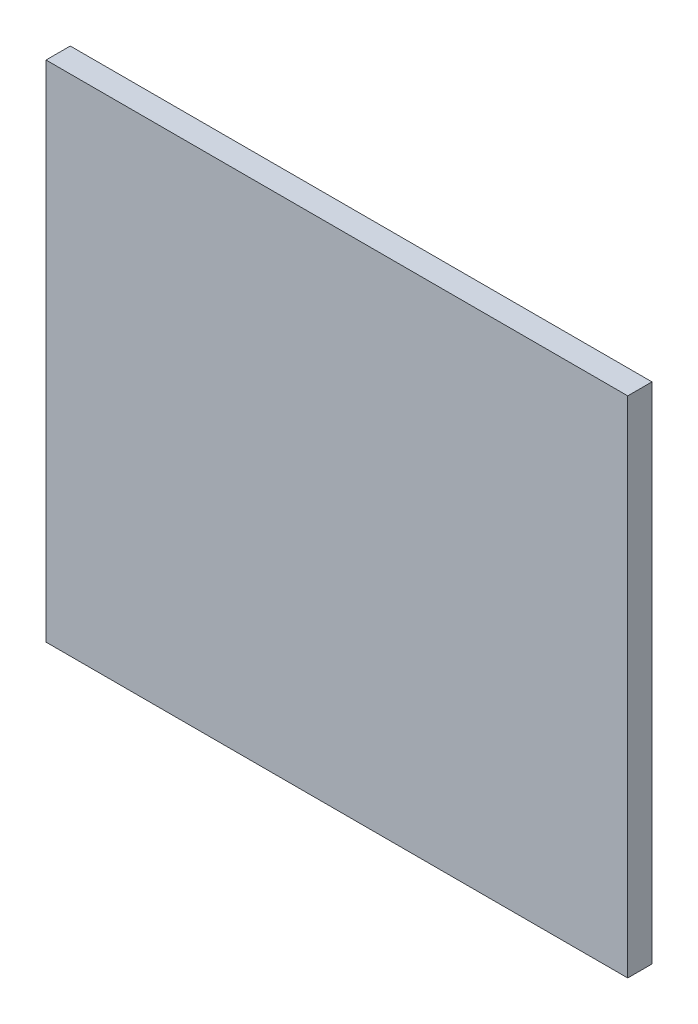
ISO-10303-21;
HEADER;
FILE_DESCRIPTION(('STEP AP214'),'2;1');
FILE_NAME('part.step','',(''),(''),'','','');
FILE_SCHEMA(('AUTOMOTIVE_DESIGN { 1 0 10303 214 1 1 1 1 }'));
ENDSEC;
DATA;
#1=APPLICATION_CONTEXT('core data for automotive mechanical design processes');
#2=APPLICATION_PROTOCOL_DEFINITION('international standard','automotive_design',2000,#1);
#3=PRODUCT_CONTEXT('',#1,'mechanical');
#4=PRODUCT('Part','Part','',(#3));
#5=PRODUCT_RELATED_PRODUCT_CATEGORY('part','',(#4));
#6=PRODUCT_DEFINITION_FORMATION('','',#4);
#7=PRODUCT_DEFINITION_CONTEXT('part definition',#1,'design');
#8=PRODUCT_DEFINITION('design','',#6,#7);
#9=PRODUCT_DEFINITION_SHAPE('','',#8);
#10=(LENGTH_UNIT() NAMED_UNIT(*) SI_UNIT(.MILLI.,.METRE.));
#11=(NAMED_UNIT(*) PLANE_ANGLE_UNIT() SI_UNIT($,.RADIAN.));
#12=(NAMED_UNIT(*) SI_UNIT($,.STERADIAN.) SOLID_ANGLE_UNIT());
#13=UNCERTAINTY_MEASURE_WITH_UNIT(LENGTH_MEASURE(1.E-05),#10,'distance_accuracy_value','');
#14=(GEOMETRIC_REPRESENTATION_CONTEXT(3) GLOBAL_UNCERTAINTY_ASSIGNED_CONTEXT((#13)) GLOBAL_UNIT_ASSIGNED_CONTEXT((#10,
#11,#12)) REPRESENTATION_CONTEXT('',''));
#15=CARTESIAN_POINT('',(0.,0.,0.));
#16=DIRECTION('',(0.,0.,1.));
#17=DIRECTION('',(1.,0.,0.));
#18=AXIS2_PLACEMENT_3D('',#15,#16,#17);
#19=CARTESIAN_POINT('',(-38.1,-33.02,3.175));
#20=DIRECTION('',(1.,0.,0.));
#21=DIRECTION('',(0.,0.,-1.));
#22=AXIS2_PLACEMENT_3D('',#19,#20,#21);
#23=PLANE('',#22);
#24=DIRECTION('',(0.,-1.,0.));
#25=VECTOR('',#24,1.);
#26=CARTESIAN_POINT('',(-38.1,-33.02,0.));
#27=LINE('',#26,#25);
#28=CARTESIAN_POINT('',(-38.1,33.02,0.));
#29=VERTEX_POINT('',#28);
#30=CARTESIAN_POINT('',(-38.1,-33.02,0.));
#31=VERTEX_POINT('',#30);
#32=EDGE_CURVE('E107',#29,#31,#27,.T.);
#33=ORIENTED_EDGE('',*,*,#32,.T.);
#34=DIRECTION('',(0.,0.,-1.));
#35=VECTOR('',#34,1.);
#36=CARTESIAN_POINT('',(-38.1,-33.02,3.175));
#37=LINE('',#36,#35);
#38=CARTESIAN_POINT('',(-38.1,-33.02,3.175));
#39=VERTEX_POINT('',#38);
#40=EDGE_CURVE('E11',#39,#31,#37,.T.);
#41=ORIENTED_EDGE('',*,*,#40,.F.);
#42=DIRECTION('',(0.,-1.,0.));
#43=VECTOR('',#42,1.);
#44=CARTESIAN_POINT('',(-38.1,-33.02,3.175));
#45=LINE('',#44,#43);
#46=CARTESIAN_POINT('',(-38.1,33.02,3.175));
#47=VERTEX_POINT('',#46);
#48=EDGE_CURVE('E91',#47,#39,#45,.T.);
#49=ORIENTED_EDGE('',*,*,#48,.F.);
#50=DIRECTION('',(0.,0.,-1.));
#51=VECTOR('',#50,1.);
#52=CARTESIAN_POINT('',(-38.1,33.02,3.175));
#53=LINE('',#52,#51);
#54=EDGE_CURVE('E103',#47,#29,#53,.T.);
#55=ORIENTED_EDGE('',*,*,#54,.T.);
#56=EDGE_LOOP('',(#33,#41,#49,#55));
#57=FACE_BOUND('',#56,.T.);
#58=ADVANCED_FACE('F39',(#57),#23,.F.);
#59=CARTESIAN_POINT('',(38.1,-33.02,3.175));
#60=DIRECTION('',(0.,1.,0.));
#61=DIRECTION('',(-1.,0.,0.));
#62=AXIS2_PLACEMENT_3D('',#59,#60,#61);
#63=PLANE('',#62);
#64=DIRECTION('',(1.,0.,0.));
#65=VECTOR('',#64,1.);
#66=CARTESIAN_POINT('',(38.1,-33.02,0.));
#67=LINE('',#66,#65);
#68=CARTESIAN_POINT('',(38.1,-33.02,0.));
#69=VERTEX_POINT('',#68);
#70=EDGE_CURVE('E96',#31,#69,#67,.T.);
#71=ORIENTED_EDGE('',*,*,#70,.T.);
#72=DIRECTION('',(0.,0.,-1.));
#73=VECTOR('',#72,1.);
#74=CARTESIAN_POINT('',(38.1,-33.02,3.175));
#75=LINE('',#74,#73);
#76=CARTESIAN_POINT('',(38.1,-33.02,3.175));
#77=VERTEX_POINT('',#76);
#78=EDGE_CURVE('E48',#77,#69,#75,.T.);
#79=ORIENTED_EDGE('',*,*,#78,.F.);
#80=DIRECTION('',(1.,0.,0.));
#81=VECTOR('',#80,1.);
#82=CARTESIAN_POINT('',(38.1,-33.02,3.175));
#83=LINE('',#82,#81);
#84=EDGE_CURVE('E86',#39,#77,#83,.T.);
#85=ORIENTED_EDGE('',*,*,#84,.F.);
#86=ORIENTED_EDGE('',*,*,#40,.T.);
#87=EDGE_LOOP('',(#71,#79,#85,#86));
#88=FACE_BOUND('',#87,.T.);
#89=ADVANCED_FACE('F95',(#88),#63,.F.);
#90=CARTESIAN_POINT('',(38.1,-33.02,3.175));
#91=DIRECTION('',(-1.,0.,0.));
#92=DIRECTION('',(0.,0.,1.));
#93=AXIS2_PLACEMENT_3D('',#90,#91,#92);
#94=PLANE('',#93);
#95=DIRECTION('',(0.,1.,0.));
#96=VECTOR('',#95,1.);
#97=CARTESIAN_POINT('',(38.1,-33.02,0.));
#98=LINE('',#97,#96);
#99=CARTESIAN_POINT('',(38.1,33.02,0.));
#100=VERTEX_POINT('',#99);
#101=EDGE_CURVE('E73',#69,#100,#98,.T.);
#102=ORIENTED_EDGE('',*,*,#101,.T.);
#103=DIRECTION('',(0.,0.,-1.));
#104=VECTOR('',#103,1.);
#105=CARTESIAN_POINT('',(38.1,33.02,3.175));
#106=LINE('',#105,#104);
#107=CARTESIAN_POINT('',(38.1,33.02,3.175));
#108=VERTEX_POINT('',#107);
#109=EDGE_CURVE('E98',#108,#100,#106,.T.);
#110=ORIENTED_EDGE('',*,*,#109,.F.);
#111=DIRECTION('',(0.,1.,0.));
#112=VECTOR('',#111,1.);
#113=CARTESIAN_POINT('',(38.1,-33.02,3.175));
#114=LINE('',#113,#112);
#115=EDGE_CURVE('E89',#77,#108,#114,.T.);
#116=ORIENTED_EDGE('',*,*,#115,.F.);
#117=ORIENTED_EDGE('',*,*,#78,.T.);
#118=EDGE_LOOP('',(#102,#110,#116,#117));
#119=FACE_BOUND('',#118,.T.);
#120=ADVANCED_FACE('F99',(#119),#94,.F.);
#121=CARTESIAN_POINT('',(38.1,33.02,3.175));
#122=DIRECTION('',(0.,-1.,0.));
#123=DIRECTION('',(1.,0.,0.));
#124=AXIS2_PLACEMENT_3D('',#121,#122,#123);
#125=PLANE('',#124);
#126=DIRECTION('',(-1.,0.,0.));
#127=VECTOR('',#126,1.);
#128=CARTESIAN_POINT('',(38.1,33.02,0.));
#129=LINE('',#128,#127);
#130=EDGE_CURVE('E79',#100,#29,#129,.T.);
#131=ORIENTED_EDGE('',*,*,#130,.T.);
#132=ORIENTED_EDGE('',*,*,#54,.F.);
#133=DIRECTION('',(-1.,0.,0.));
#134=VECTOR('',#133,1.);
#135=CARTESIAN_POINT('',(38.1,33.02,3.175));
#136=LINE('',#135,#134);
#137=EDGE_CURVE('E56',#108,#47,#136,.T.);
#138=ORIENTED_EDGE('',*,*,#137,.F.);
#139=ORIENTED_EDGE('',*,*,#109,.T.);
#140=EDGE_LOOP('',(#131,#132,#138,#139));
#141=FACE_BOUND('',#140,.T.);
#142=ADVANCED_FACE('F120',(#141),#125,.F.);
#143=CARTESIAN_POINT('',(0.,0.,3.175));
#144=DIRECTION('',(0.,0.,1.));
#145=DIRECTION('',(1.,0.,0.));
#146=AXIS2_PLACEMENT_3D('',#143,#144,#145);
#147=PLANE('',#146);
#148=ORIENTED_EDGE('',*,*,#48,.T.);
#149=ORIENTED_EDGE('',*,*,#84,.T.);
#150=ORIENTED_EDGE('',*,*,#115,.T.);
#151=ORIENTED_EDGE('',*,*,#137,.T.);
#152=EDGE_LOOP('',(#148,#149,#150,#151));
#153=FACE_BOUND('',#152,.T.);
#154=ADVANCED_FACE('F87',(#153),#147,.T.);
#155=CARTESIAN_POINT('',(0.,0.,0.));
#156=DIRECTION('',(0.,0.,1.));
#157=DIRECTION('',(1.,0.,0.));
#158=AXIS2_PLACEMENT_3D('',#155,#156,#157);
#159=PLANE('',#158);
#160=ORIENTED_EDGE('',*,*,#32,.F.);
#161=ORIENTED_EDGE('',*,*,#130,.F.);
#162=ORIENTED_EDGE('',*,*,#101,.F.);
#163=ORIENTED_EDGE('',*,*,#70,.F.);
#164=EDGE_LOOP('',(#160,#161,#162,#163));
#165=FACE_BOUND('',#164,.T.);
#166=ADVANCED_FACE('F123',(#165),#159,.F.);
#167=CLOSED_SHELL('',(#58,#89,#120,#142,#154,#166));
#168=MANIFOLD_SOLID_BREP('B2',#167);
#169=ADVANCED_BREP_SHAPE_REPRESENTATION('',(#18,#168),#14);
#170=SHAPE_DEFINITION_REPRESENTATION(#9,#169);
ENDSEC;
END-ISO-10303-21;
